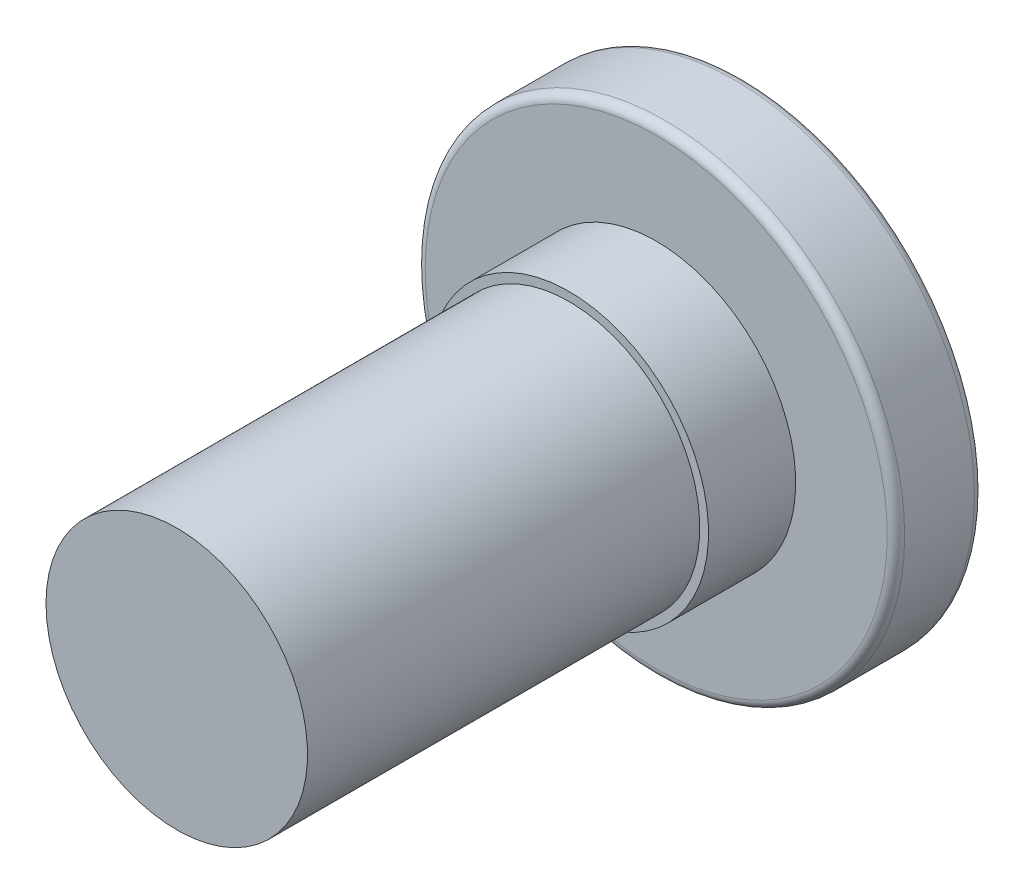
ISO-10303-21;
HEADER;
FILE_DESCRIPTION(('STEP AP214'),'2;1');
FILE_NAME('part.step','',(''),(''),'','','');
FILE_SCHEMA(('AUTOMOTIVE_DESIGN { 1 0 10303 214 1 1 1 1 }'));
ENDSEC;
DATA;
#1=APPLICATION_CONTEXT('core data for automotive mechanical design processes');
#2=APPLICATION_PROTOCOL_DEFINITION('international standard','automotive_design',2000,#1);
#3=PRODUCT_CONTEXT('',#1,'mechanical');
#4=PRODUCT('Part','Part','',(#3));
#5=PRODUCT_RELATED_PRODUCT_CATEGORY('part','',(#4));
#6=PRODUCT_DEFINITION_FORMATION('','',#4);
#7=PRODUCT_DEFINITION_CONTEXT('part definition',#1,'design');
#8=PRODUCT_DEFINITION('design','',#6,#7);
#9=PRODUCT_DEFINITION_SHAPE('','',#8);
#10=(LENGTH_UNIT() NAMED_UNIT(*) SI_UNIT(.MILLI.,.METRE.));
#11=(NAMED_UNIT(*) PLANE_ANGLE_UNIT() SI_UNIT($,.RADIAN.));
#12=(NAMED_UNIT(*) SI_UNIT($,.STERADIAN.) SOLID_ANGLE_UNIT());
#13=UNCERTAINTY_MEASURE_WITH_UNIT(LENGTH_MEASURE(1.E-05),#10,'distance_accuracy_value','');
#14=(GEOMETRIC_REPRESENTATION_CONTEXT(3) GLOBAL_UNCERTAINTY_ASSIGNED_CONTEXT((#13)) GLOBAL_UNIT_ASSIGNED_CONTEXT((#10,
#11,#12)) REPRESENTATION_CONTEXT('',''));
#15=CARTESIAN_POINT('',(0.,0.,0.));
#16=DIRECTION('',(0.,0.,1.));
#17=DIRECTION('',(1.,0.,0.));
#18=AXIS2_PLACEMENT_3D('',#15,#16,#17);
#19=CARTESIAN_POINT('',(0.,0.,1.));
#20=DIRECTION('',(0.,0.,1.));
#21=DIRECTION('',(1.,0.,0.));
#22=AXIS2_PLACEMENT_3D('',#19,#20,#21);
#23=PLANE('',#22);
#24=DIRECTION('',(0.,-1.,0.));
#25=VECTOR('',#24,1.);
#26=CARTESIAN_POINT('',(0.999999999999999,-0.577350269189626,1.));
#27=LINE('',#26,#25);
#28=CARTESIAN_POINT('',(0.999999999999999,-0.577350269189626,1.));
#29=VERTEX_POINT('',#28);
#30=CARTESIAN_POINT('',(0.999999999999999,0.577350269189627,1.));
#31=VERTEX_POINT('',#30);
#32=EDGE_CURVE('E84',#29,#31,#27,.F.);
#33=ORIENTED_EDGE('',*,*,#32,.F.);
#34=DIRECTION('',(-0.866025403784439,-0.5,0.));
#35=VECTOR('',#34,1.);
#36=CARTESIAN_POINT('',(0.,-1.15470053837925,1.));
#37=LINE('',#36,#35);
#38=CARTESIAN_POINT('',(0.,-1.15470053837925,1.));
#39=VERTEX_POINT('',#38);
#40=EDGE_CURVE('E81',#39,#29,#37,.F.);
#41=ORIENTED_EDGE('',*,*,#40,.F.);
#42=DIRECTION('',(-0.866025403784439,0.5,0.));
#43=VECTOR('',#42,1.);
#44=CARTESIAN_POINT('',(-1.,-0.577350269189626,1.));
#45=LINE('',#44,#43);
#46=CARTESIAN_POINT('',(-1.,-0.577350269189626,1.));
#47=VERTEX_POINT('',#46);
#48=EDGE_CURVE('E98',#47,#39,#45,.F.);
#49=ORIENTED_EDGE('',*,*,#48,.F.);
#50=DIRECTION('',(0.,1.,0.));
#51=VECTOR('',#50,1.);
#52=CARTESIAN_POINT('',(-1.,0.577350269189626,1.));
#53=LINE('',#52,#51);
#54=CARTESIAN_POINT('',(-1.,0.577350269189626,1.));
#55=VERTEX_POINT('',#54);
#56=EDGE_CURVE('E194',#55,#47,#53,.F.);
#57=ORIENTED_EDGE('',*,*,#56,.F.);
#58=DIRECTION('',(0.866025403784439,0.5,0.));
#59=VECTOR('',#58,1.);
#60=CARTESIAN_POINT('',(0.,1.15470053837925,1.));
#61=LINE('',#60,#59);
#62=CARTESIAN_POINT('',(0.,1.15470053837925,1.));
#63=VERTEX_POINT('',#62);
#64=EDGE_CURVE('E188',#63,#55,#61,.F.);
#65=ORIENTED_EDGE('',*,*,#64,.F.);
#66=DIRECTION('',(0.866025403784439,-0.5,0.));
#67=VECTOR('',#66,1.);
#68=CARTESIAN_POINT('',(0.999999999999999,0.577350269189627,1.));
#69=LINE('',#68,#67);
#70=EDGE_CURVE('E87',#31,#63,#69,.F.);
#71=ORIENTED_EDGE('',*,*,#70,.F.);
#72=EDGE_LOOP('',(#33,#41,#49,#57,#65,#71));
#73=FACE_BOUND('',#72,.T.);
#74=ADVANCED_FACE('F17',(#73),#23,.F.);
#75=CARTESIAN_POINT('',(0.999999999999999,-0.577350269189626,1.));
#76=DIRECTION('',(-1.,0.,0.));
#77=DIRECTION('',(0.,-1.,0.));
#78=AXIS2_PLACEMENT_3D('',#75,#76,#77);
#79=PLANE('',#78);
#80=ORIENTED_EDGE('',*,*,#32,.T.);
#81=DIRECTION('',(0.,0.,1.));
#82=VECTOR('',#81,1.);
#83=CARTESIAN_POINT('',(0.999999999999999,0.577350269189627,1.));
#84=LINE('',#83,#82);
#85=CARTESIAN_POINT('',(0.999999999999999,0.577350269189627,0.));
#86=VERTEX_POINT('',#85);
#87=EDGE_CURVE('E183',#86,#31,#84,.T.);
#88=ORIENTED_EDGE('',*,*,#87,.F.);
#89=DIRECTION('',(0.,1.,0.));
#90=VECTOR('',#89,1.);
#91=CARTESIAN_POINT('',(0.999999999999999,0.,0.));
#92=LINE('',#91,#90);
#93=CARTESIAN_POINT('',(0.999999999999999,-0.577350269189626,0.));
#94=VERTEX_POINT('',#93);
#95=EDGE_CURVE('E95',#86,#94,#92,.F.);
#96=ORIENTED_EDGE('',*,*,#95,.T.);
#97=DIRECTION('',(0.,0.,1.));
#98=VECTOR('',#97,1.);
#99=CARTESIAN_POINT('',(0.999999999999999,-0.577350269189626,1.));
#100=LINE('',#99,#98);
#101=EDGE_CURVE('E92',#29,#94,#100,.F.);
#102=ORIENTED_EDGE('',*,*,#101,.F.);
#103=EDGE_LOOP('',(#80,#88,#96,#102));
#104=FACE_BOUND('',#103,.T.);
#105=ADVANCED_FACE('F93',(#104),#79,.T.);
#106=CARTESIAN_POINT('',(0.,-1.15470053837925,1.));
#107=DIRECTION('',(-0.5,0.866025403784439,0.));
#108=DIRECTION('',(-0.866025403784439,-0.5,0.));
#109=AXIS2_PLACEMENT_3D('',#106,#107,#108);
#110=PLANE('',#109);
#111=ORIENTED_EDGE('',*,*,#40,.T.);
#112=ORIENTED_EDGE('',*,*,#101,.T.);
#113=DIRECTION('',(-0.866025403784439,-0.5,0.));
#114=VECTOR('',#113,1.);
#115=CARTESIAN_POINT('',(0.999999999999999,-0.577350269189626,0.));
#116=LINE('',#115,#114);
#117=CARTESIAN_POINT('',(0.,-1.15470053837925,0.));
#118=VERTEX_POINT('',#117);
#119=EDGE_CURVE('E220',#94,#118,#116,.T.);
#120=ORIENTED_EDGE('',*,*,#119,.T.);
#121=DIRECTION('',(0.,0.,1.));
#122=VECTOR('',#121,1.);
#123=CARTESIAN_POINT('',(0.,-1.15470053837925,1.));
#124=LINE('',#123,#122);
#125=EDGE_CURVE('E102',#39,#118,#124,.F.);
#126=ORIENTED_EDGE('',*,*,#125,.F.);
#127=EDGE_LOOP('',(#111,#112,#120,#126));
#128=FACE_BOUND('',#127,.T.);
#129=ADVANCED_FACE('F100',(#128),#110,.T.);
#130=CARTESIAN_POINT('',(-1.,-0.577350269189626,1.));
#131=DIRECTION('',(0.5,0.866025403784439,0.));
#132=DIRECTION('',(-0.866025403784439,0.5,0.));
#133=AXIS2_PLACEMENT_3D('',#130,#131,#132);
#134=PLANE('',#133);
#135=ORIENTED_EDGE('',*,*,#48,.T.);
#136=ORIENTED_EDGE('',*,*,#125,.T.);
#137=DIRECTION('',(-0.866025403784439,0.5,0.));
#138=VECTOR('',#137,1.);
#139=CARTESIAN_POINT('',(0.,-1.15470053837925,0.));
#140=LINE('',#139,#138);
#141=CARTESIAN_POINT('',(-1.,-0.577350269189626,0.));
#142=VERTEX_POINT('',#141);
#143=EDGE_CURVE('E221',#118,#142,#140,.T.);
#144=ORIENTED_EDGE('',*,*,#143,.T.);
#145=DIRECTION('',(0.,0.,1.));
#146=VECTOR('',#145,1.);
#147=CARTESIAN_POINT('',(-1.,-0.577350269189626,1.));
#148=LINE('',#147,#146);
#149=EDGE_CURVE('E191',#47,#142,#148,.F.);
#150=ORIENTED_EDGE('',*,*,#149,.F.);
#151=EDGE_LOOP('',(#135,#136,#144,#150));
#152=FACE_BOUND('',#151,.T.);
#153=ADVANCED_FACE('F199',(#152),#134,.T.);
#154=CARTESIAN_POINT('',(-1.,0.577350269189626,1.));
#155=DIRECTION('',(1.,0.,0.));
#156=DIRECTION('',(0.,1.,0.));
#157=AXIS2_PLACEMENT_3D('',#154,#155,#156);
#158=PLANE('',#157);
#159=ORIENTED_EDGE('',*,*,#56,.T.);
#160=ORIENTED_EDGE('',*,*,#149,.T.);
#161=DIRECTION('',(0.,1.,0.));
#162=VECTOR('',#161,1.);
#163=CARTESIAN_POINT('',(-1.,0.,0.));
#164=LINE('',#163,#162);
#165=CARTESIAN_POINT('',(-1.,0.577350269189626,0.));
#166=VERTEX_POINT('',#165);
#167=EDGE_CURVE('E206',#142,#166,#164,.T.);
#168=ORIENTED_EDGE('',*,*,#167,.T.);
#169=DIRECTION('',(0.,0.,1.));
#170=VECTOR('',#169,1.);
#171=CARTESIAN_POINT('',(-1.,0.577350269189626,1.));
#172=LINE('',#171,#170);
#173=EDGE_CURVE('E185',#55,#166,#172,.F.);
#174=ORIENTED_EDGE('',*,*,#173,.F.);
#175=EDGE_LOOP('',(#159,#160,#168,#174));
#176=FACE_BOUND('',#175,.T.);
#177=ADVANCED_FACE('F204',(#176),#158,.T.);
#178=CARTESIAN_POINT('',(0.,1.15470053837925,1.));
#179=DIRECTION('',(0.5,-0.866025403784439,0.));
#180=DIRECTION('',(0.866025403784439,0.5,0.));
#181=AXIS2_PLACEMENT_3D('',#178,#179,#180);
#182=PLANE('',#181);
#183=ORIENTED_EDGE('',*,*,#64,.T.);
#184=ORIENTED_EDGE('',*,*,#173,.T.);
#185=DIRECTION('',(0.866025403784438,0.5,0.));
#186=VECTOR('',#185,1.);
#187=CARTESIAN_POINT('',(-1.,0.577350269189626,0.));
#188=LINE('',#187,#186);
#189=CARTESIAN_POINT('',(0.,1.15470053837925,0.));
#190=VERTEX_POINT('',#189);
#191=EDGE_CURVE('E210',#166,#190,#188,.T.);
#192=ORIENTED_EDGE('',*,*,#191,.T.);
#193=DIRECTION('',(0.,0.,1.));
#194=VECTOR('',#193,1.);
#195=CARTESIAN_POINT('',(0.,1.15470053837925,1.));
#196=LINE('',#195,#194);
#197=EDGE_CURVE('E174',#63,#190,#196,.F.);
#198=ORIENTED_EDGE('',*,*,#197,.F.);
#199=EDGE_LOOP('',(#183,#184,#192,#198));
#200=FACE_BOUND('',#199,.T.);
#201=ADVANCED_FACE('F209',(#200),#182,.T.);
#202=CARTESIAN_POINT('',(0.999999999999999,0.577350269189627,1.));
#203=DIRECTION('',(-0.5,-0.866025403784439,0.));
#204=DIRECTION('',(0.866025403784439,-0.5,0.));
#205=AXIS2_PLACEMENT_3D('',#202,#203,#204);
#206=PLANE('',#205);
#207=ORIENTED_EDGE('',*,*,#70,.T.);
#208=ORIENTED_EDGE('',*,*,#197,.T.);
#209=DIRECTION('',(0.866025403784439,-0.5,0.));
#210=VECTOR('',#209,1.);
#211=CARTESIAN_POINT('',(0.,1.15470053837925,0.));
#212=LINE('',#211,#210);
#213=EDGE_CURVE('E215',#190,#86,#212,.T.);
#214=ORIENTED_EDGE('',*,*,#213,.T.);
#215=ORIENTED_EDGE('',*,*,#87,.T.);
#216=EDGE_LOOP('',(#207,#208,#214,#215));
#217=FACE_BOUND('',#216,.T.);
#218=ADVANCED_FACE('F214',(#217),#206,.T.);
#219=CARTESIAN_POINT('',(0.,0.,0.));
#220=DIRECTION('',(0.,0.,1.));
#221=DIRECTION('',(1.,0.,0.));
#222=AXIS2_PLACEMENT_3D('',#219,#220,#221);
#223=PLANE('',#222);
#224=ORIENTED_EDGE('',*,*,#191,.F.);
#225=ORIENTED_EDGE('',*,*,#167,.F.);
#226=ORIENTED_EDGE('',*,*,#143,.F.);
#227=ORIENTED_EDGE('',*,*,#119,.F.);
#228=ORIENTED_EDGE('',*,*,#95,.F.);
#229=ORIENTED_EDGE('',*,*,#213,.F.);
#230=EDGE_LOOP('',(#224,#225,#226,#227,#228,#229));
#231=FACE_BOUND('',#230,.T.);
#232=CARTESIAN_POINT('',(0.,0.,0.));
#233=DIRECTION('',(0.,0.,1.));
#234=DIRECTION('',(1.,0.,0.));
#235=AXIS2_PLACEMENT_3D('',#232,#233,#234);
#236=CIRCLE('',#235,2.65);
#237=CARTESIAN_POINT('',(2.65,0.,0.));
#238=VERTEX_POINT('',#237);
#239=CARTESIAN_POINT('',(-2.65,0.,0.));
#240=VERTEX_POINT('',#239);
#241=EDGE_CURVE('E217',#238,#240,#236,.T.);
#242=ORIENTED_EDGE('',*,*,#241,.F.);
#243=CARTESIAN_POINT('',(0.,0.,0.));
#244=DIRECTION('',(0.,0.,1.));
#245=DIRECTION('',(-1.,0.,0.));
#246=AXIS2_PLACEMENT_3D('',#243,#244,#245);
#247=CIRCLE('',#246,2.65);
#248=EDGE_CURVE('E237',#240,#238,#247,.T.);
#249=ORIENTED_EDGE('',*,*,#248,.F.);
#250=EDGE_LOOP('',(#242,#249));
#251=FACE_BOUND('',#250,.T.);
#252=ADVANCED_FACE('F162',(#231,#251),#223,.F.);
#253=CARTESIAN_POINT('',(0.,0.,0.1));
#254=DIRECTION('',(0.,0.,1.));
#255=DIRECTION('',(1.,0.,0.));
#256=AXIS2_PLACEMENT_3D('',#253,#254,#255);
#257=TOROIDAL_SURFACE('',#256,2.65,0.1);
#258=ORIENTED_EDGE('',*,*,#241,.T.);
#259=ORIENTED_EDGE('',*,*,#248,.T.);
#260=EDGE_LOOP('',(#258,#259));
#261=FACE_BOUND('',#260,.T.);
#262=CARTESIAN_POINT('',(0.,0.,0.1));
#263=DIRECTION('',(0.,0.,-1.));
#264=DIRECTION('',(-1.,0.,0.));
#265=AXIS2_PLACEMENT_3D('',#262,#263,#264);
#266=CIRCLE('',#265,2.75);
#267=CARTESIAN_POINT('',(-2.75,0.,0.1));
#268=VERTEX_POINT('',#267);
#269=EDGE_CURVE('E154',#268,#268,#266,.F.);
#270=ORIENTED_EDGE('',*,*,#269,.F.);
#271=EDGE_LOOP('',(#270));
#272=FACE_BOUND('',#271,.T.);
#273=ADVANCED_FACE('F158',(#261,#272),#257,.T.);
#274=CARTESIAN_POINT('',(0.,0.,1.));
#275=DIRECTION('',(0.,0.,-1.));
#276=DIRECTION('',(-1.,0.,0.));
#277=AXIS2_PLACEMENT_3D('',#274,#275,#276);
#278=CYLINDRICAL_SURFACE('',#277,2.75);
#279=CARTESIAN_POINT('',(0.,0.,0.9));
#280=DIRECTION('',(0.,0.,1.));
#281=DIRECTION('',(1.,0.,0.));
#282=AXIS2_PLACEMENT_3D('',#279,#280,#281);
#283=CIRCLE('',#282,2.75);
#284=CARTESIAN_POINT('',(2.75,0.,0.9));
#285=VERTEX_POINT('',#284);
#286=EDGE_CURVE('E146',#285,#285,#283,.T.);
#287=ORIENTED_EDGE('',*,*,#286,.F.);
#288=EDGE_LOOP('',(#287));
#289=FACE_BOUND('',#288,.T.);
#290=ORIENTED_EDGE('',*,*,#269,.T.);
#291=EDGE_LOOP('',(#290));
#292=FACE_BOUND('',#291,.T.);
#293=ADVANCED_FACE('F132',(#289,#292),#278,.T.);
#294=CARTESIAN_POINT('',(0.,0.,0.9));
#295=DIRECTION('',(0.,0.,1.));
#296=DIRECTION('',(1.,0.,0.));
#297=AXIS2_PLACEMENT_3D('',#294,#295,#296);
#298=TOROIDAL_SURFACE('',#297,2.65,0.1);
#299=ORIENTED_EDGE('',*,*,#286,.T.);
#300=EDGE_LOOP('',(#299));
#301=FACE_BOUND('',#300,.T.);
#302=CARTESIAN_POINT('',(0.,0.,1.));
#303=DIRECTION('',(0.,0.,-1.));
#304=DIRECTION('',(1.,0.,0.));
#305=AXIS2_PLACEMENT_3D('',#302,#303,#304);
#306=CIRCLE('',#305,2.65);
#307=CARTESIAN_POINT('',(-2.65,0.,1.));
#308=VERTEX_POINT('',#307);
#309=CARTESIAN_POINT('',(2.65,0.,1.));
#310=VERTEX_POINT('',#309);
#311=EDGE_CURVE('E36',#308,#310,#306,.F.);
#312=ORIENTED_EDGE('',*,*,#311,.F.);
#313=CARTESIAN_POINT('',(0.,0.,1.));
#314=DIRECTION('',(0.,0.,-1.));
#315=DIRECTION('',(-1.,0.,0.));
#316=AXIS2_PLACEMENT_3D('',#313,#314,#315);
#317=CIRCLE('',#316,2.65);
#318=EDGE_CURVE('E116',#310,#308,#317,.F.);
#319=ORIENTED_EDGE('',*,*,#318,.F.);
#320=EDGE_LOOP('',(#312,#319));
#321=FACE_BOUND('',#320,.T.);
#322=ADVANCED_FACE('F120',(#301,#321),#298,.T.);
#323=CARTESIAN_POINT('',(0.,0.,1.));
#324=DIRECTION('',(0.,0.,1.));
#325=DIRECTION('',(1.,0.,0.));
#326=AXIS2_PLACEMENT_3D('',#323,#324,#325);
#327=PLANE('',#326);
#328=CARTESIAN_POINT('',(0.,0.,1.));
#329=DIRECTION('',(0.,0.,-1.));
#330=DIRECTION('',(-1.,0.,0.));
#331=AXIS2_PLACEMENT_3D('',#328,#329,#330);
#332=CIRCLE('',#331,1.6);
#333=CARTESIAN_POINT('',(-1.6,0.,1.));
#334=VERTEX_POINT('',#333);
#335=EDGE_CURVE('E112',#334,#334,#332,.F.);
#336=ORIENTED_EDGE('',*,*,#335,.F.);
#337=EDGE_LOOP('',(#336));
#338=FACE_BOUND('',#337,.T.);
#339=ORIENTED_EDGE('',*,*,#318,.T.);
#340=ORIENTED_EDGE('',*,*,#311,.T.);
#341=EDGE_LOOP('',(#339,#340));
#342=FACE_BOUND('',#341,.T.);
#343=ADVANCED_FACE('F131',(#338,#342),#327,.T.);
#344=CARTESIAN_POINT('',(0.,0.,2.));
#345=DIRECTION('',(0.,0.,-1.));
#346=DIRECTION('',(-1.,0.,0.));
#347=AXIS2_PLACEMENT_3D('',#344,#345,#346);
#348=CYLINDRICAL_SURFACE('',#347,1.6);
#349=ORIENTED_EDGE('',*,*,#335,.T.);
#350=EDGE_LOOP('',(#349));
#351=FACE_BOUND('',#350,.T.);
#352=CARTESIAN_POINT('',(0.,0.,2.));
#353=DIRECTION('',(0.,0.,-1.));
#354=DIRECTION('',(-1.,0.,0.));
#355=AXIS2_PLACEMENT_3D('',#352,#353,#354);
#356=CIRCLE('',#355,1.6);
#357=CARTESIAN_POINT('',(-1.6,0.,2.));
#358=VERTEX_POINT('',#357);
#359=EDGE_CURVE('E109',#358,#358,#356,.F.);
#360=ORIENTED_EDGE('',*,*,#359,.F.);
#361=EDGE_LOOP('',(#360));
#362=FACE_BOUND('',#361,.T.);
#363=ADVANCED_FACE('F269',(#351,#362),#348,.T.);
#364=CARTESIAN_POINT('',(0.,0.,6.5));
#365=DIRECTION('',(0.,0.,1.));
#366=DIRECTION('',(1.,0.,0.));
#367=AXIS2_PLACEMENT_3D('',#364,#365,#366);
#368=PLANE('',#367);
#369=CARTESIAN_POINT('',(0.,0.,6.5));
#370=DIRECTION('',(0.,0.,-1.));
#371=DIRECTION('',(-1.,0.,0.));
#372=AXIS2_PLACEMENT_3D('',#369,#370,#371);
#373=CIRCLE('',#372,1.5);
#374=CARTESIAN_POINT('',(-1.5,0.,6.5));
#375=VERTEX_POINT('',#374);
#376=EDGE_CURVE('E28',#375,#375,#373,.T.);
#377=ORIENTED_EDGE('',*,*,#376,.F.);
#378=EDGE_LOOP('',(#377));
#379=FACE_BOUND('',#378,.T.);
#380=ADVANCED_FACE('F263',(#379),#368,.T.);
#381=CARTESIAN_POINT('',(0.,0.,2.));
#382=DIRECTION('',(0.,0.,1.));
#383=DIRECTION('',(1.,0.,0.));
#384=AXIS2_PLACEMENT_3D('',#381,#382,#383);
#385=PLANE('',#384);
#386=CARTESIAN_POINT('',(0.,0.,2.));
#387=DIRECTION('',(0.,0.,-1.));
#388=DIRECTION('',(-1.,0.,0.));
#389=AXIS2_PLACEMENT_3D('',#386,#387,#388);
#390=CIRCLE('',#389,1.5);
#391=CARTESIAN_POINT('',(-1.5,0.,2.));
#392=VERTEX_POINT('',#391);
#393=EDGE_CURVE('E11',#392,#392,#390,.F.);
#394=ORIENTED_EDGE('',*,*,#393,.F.);
#395=EDGE_LOOP('',(#394));
#396=FACE_BOUND('',#395,.T.);
#397=ORIENTED_EDGE('',*,*,#359,.T.);
#398=EDGE_LOOP('',(#397));
#399=FACE_BOUND('',#398,.T.);
#400=ADVANCED_FACE('F257',(#396,#399),#385,.T.);
#401=CARTESIAN_POINT('',(0.,0.,6.5));
#402=DIRECTION('',(0.,0.,-1.));
#403=DIRECTION('',(-1.,0.,0.));
#404=AXIS2_PLACEMENT_3D('',#401,#402,#403);
#405=CYLINDRICAL_SURFACE('',#404,1.5);
#406=ORIENTED_EDGE('',*,*,#393,.T.);
#407=EDGE_LOOP('',(#406));
#408=FACE_BOUND('',#407,.T.);
#409=ORIENTED_EDGE('',*,*,#376,.T.);
#410=EDGE_LOOP('',(#409));
#411=FACE_BOUND('',#410,.T.);
#412=ADVANCED_FACE('F255',(#408,#411),#405,.T.);
#413=CLOSED_SHELL('',(#74,#105,#129,#153,#177,#201,#218,#252,#273,#293,#322,#343,#363,#380,#400,#412));
#414=MANIFOLD_SOLID_BREP('B1',#413);
#415=ADVANCED_BREP_SHAPE_REPRESENTATION('',(#18,#414),#14);
#416=SHAPE_DEFINITION_REPRESENTATION(#9,#415);
ENDSEC;
END-ISO-10303-21;
